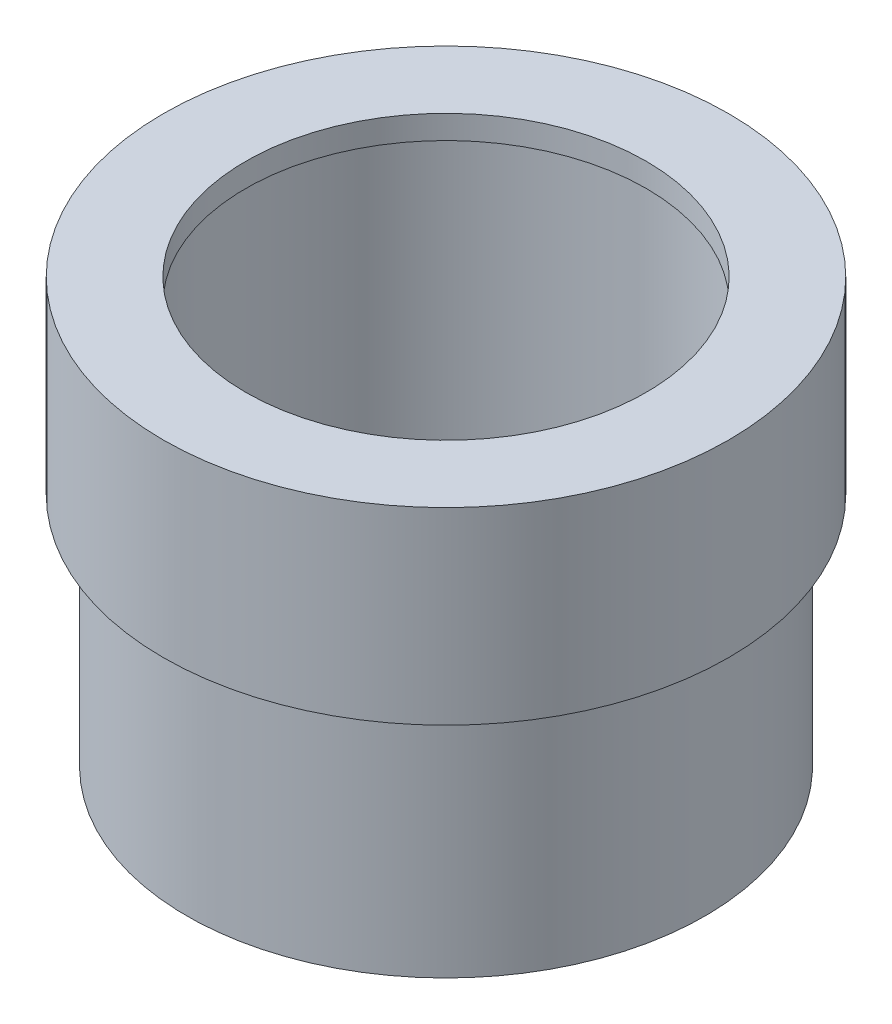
ISO-10303-21;
HEADER;
FILE_DESCRIPTION(('STEP AP214'),'2;1');
FILE_NAME('part.step','',(''),(''),'','','');
FILE_SCHEMA(('AUTOMOTIVE_DESIGN { 1 0 10303 214 1 1 1 1 }'));
ENDSEC;
DATA;
#1=APPLICATION_CONTEXT('core data for automotive mechanical design processes');
#2=APPLICATION_PROTOCOL_DEFINITION('international standard','automotive_design',2000,#1);
#3=PRODUCT_CONTEXT('',#1,'mechanical');
#4=PRODUCT('Part','Part','',(#3));
#5=PRODUCT_RELATED_PRODUCT_CATEGORY('part','',(#4));
#6=PRODUCT_DEFINITION_FORMATION('','',#4);
#7=PRODUCT_DEFINITION_CONTEXT('part definition',#1,'design');
#8=PRODUCT_DEFINITION('design','',#6,#7);
#9=PRODUCT_DEFINITION_SHAPE('','',#8);
#10=(LENGTH_UNIT() NAMED_UNIT(*) SI_UNIT(.MILLI.,.METRE.));
#11=(NAMED_UNIT(*) PLANE_ANGLE_UNIT() SI_UNIT($,.RADIAN.));
#12=(NAMED_UNIT(*) SI_UNIT($,.STERADIAN.) SOLID_ANGLE_UNIT());
#13=UNCERTAINTY_MEASURE_WITH_UNIT(LENGTH_MEASURE(1.E-05),#10,'distance_accuracy_value','');
#14=(GEOMETRIC_REPRESENTATION_CONTEXT(3) GLOBAL_UNCERTAINTY_ASSIGNED_CONTEXT((#13)) GLOBAL_UNIT_ASSIGNED_CONTEXT((#10,
#11,#12)) REPRESENTATION_CONTEXT('',''));
#15=CARTESIAN_POINT('',(0.,0.,0.));
#16=DIRECTION('',(0.,0.,1.));
#17=DIRECTION('',(1.,0.,0.));
#18=AXIS2_PLACEMENT_3D('',#15,#16,#17);
#19=CARTESIAN_POINT('',(17.4625,0.,0.));
#20=DIRECTION('',(0.,-1.,0.));
#21=DIRECTION('',(0.,0.,-1.));
#22=AXIS2_PLACEMENT_3D('',#19,#20,#21);
#23=PLANE('',#22);
#24=CARTESIAN_POINT('',(0.,0.,0.));
#25=DIRECTION('',(0.,-1.,0.));
#26=DIRECTION('',(0.,0.,-1.));
#27=AXIS2_PLACEMENT_3D('',#24,#25,#26);
#28=CIRCLE('',#27,17.4625);
#29=CARTESIAN_POINT('',(0.,0.,-17.4625));
#30=VERTEX_POINT('',#29);
#31=EDGE_CURVE('E56',#30,#30,#28,.T.);
#32=ORIENTED_EDGE('',*,*,#31,.T.);
#33=EDGE_LOOP('',(#32));
#34=FACE_BOUND('',#33,.T.);
#35=CARTESIAN_POINT('',(0.,0.,0.));
#36=DIRECTION('',(0.,-1.,0.));
#37=DIRECTION('',(0.,0.,-1.));
#38=AXIS2_PLACEMENT_3D('',#35,#36,#37);
#39=CIRCLE('',#38,14.2875);
#40=CARTESIAN_POINT('',(0.,0.,-14.2875));
#41=VERTEX_POINT('',#40);
#42=EDGE_CURVE('E10',#41,#41,#39,.T.);
#43=ORIENTED_EDGE('',*,*,#42,.F.);
#44=EDGE_LOOP('',(#43));
#45=FACE_BOUND('',#44,.T.);
#46=ADVANCED_FACE('F28',(#34,#45),#23,.T.);
#47=CARTESIAN_POINT('',(0.,0.,0.));
#48=DIRECTION('',(0.,-1.,0.));
#49=DIRECTION('',(0.,0.,-1.));
#50=AXIS2_PLACEMENT_3D('',#47,#48,#49);
#51=CYLINDRICAL_SURFACE('',#50,14.2875);
#52=ORIENTED_EDGE('',*,*,#42,.T.);
#53=EDGE_LOOP('',(#52));
#54=FACE_BOUND('',#53,.T.);
#55=CARTESIAN_POINT('',(0.,26.9875,0.));
#56=DIRECTION('',(0.,-1.,0.));
#57=DIRECTION('',(0.,0.,-1.));
#58=AXIS2_PLACEMENT_3D('',#55,#56,#57);
#59=CIRCLE('',#58,14.2875);
#60=CARTESIAN_POINT('',(0.,26.9875,-14.2875));
#61=VERTEX_POINT('',#60);
#62=EDGE_CURVE('E34',#61,#61,#59,.T.);
#63=ORIENTED_EDGE('',*,*,#62,.F.);
#64=EDGE_LOOP('',(#63));
#65=FACE_BOUND('',#64,.T.);
#66=ADVANCED_FACE('F74',(#54,#65),#51,.F.);
#67=CARTESIAN_POINT('',(14.2875,26.9875,0.));
#68=DIRECTION('',(0.,-1.,0.));
#69=DIRECTION('',(0.,0.,-1.));
#70=AXIS2_PLACEMENT_3D('',#67,#68,#69);
#71=PLANE('',#70);
#72=ORIENTED_EDGE('',*,*,#62,.T.);
#73=EDGE_LOOP('',(#72));
#74=FACE_BOUND('',#73,.T.);
#75=CARTESIAN_POINT('',(0.,26.9875,0.));
#76=DIRECTION('',(0.,-1.,0.));
#77=DIRECTION('',(0.,0.,-1.));
#78=AXIS2_PLACEMENT_3D('',#75,#76,#77);
#79=CIRCLE('',#78,13.49375);
#80=CARTESIAN_POINT('',(0.,26.9875,-13.49375));
#81=VERTEX_POINT('',#80);
#82=EDGE_CURVE('E38',#81,#81,#79,.T.);
#83=ORIENTED_EDGE('',*,*,#82,.F.);
#84=EDGE_LOOP('',(#83));
#85=FACE_BOUND('',#84,.T.);
#86=ADVANCED_FACE('F78',(#74,#85),#71,.T.);
#87=CARTESIAN_POINT('',(0.,0.,0.));
#88=DIRECTION('',(0.,-1.,0.));
#89=DIRECTION('',(0.,0.,-1.));
#90=AXIS2_PLACEMENT_3D('',#87,#88,#89);
#91=CYLINDRICAL_SURFACE('',#90,13.49375);
#92=ORIENTED_EDGE('',*,*,#82,.T.);
#93=EDGE_LOOP('',(#92));
#94=FACE_BOUND('',#93,.T.);
#95=CARTESIAN_POINT('',(0.,28.575,0.));
#96=DIRECTION('',(0.,-1.,0.));
#97=DIRECTION('',(0.,0.,-1.));
#98=AXIS2_PLACEMENT_3D('',#95,#96,#97);
#99=CIRCLE('',#98,13.49375);
#100=CARTESIAN_POINT('',(0.,28.575,-13.49375));
#101=VERTEX_POINT('',#100);
#102=EDGE_CURVE('E42',#101,#101,#99,.T.);
#103=ORIENTED_EDGE('',*,*,#102,.F.);
#104=EDGE_LOOP('',(#103));
#105=FACE_BOUND('',#104,.T.);
#106=ADVANCED_FACE('F82',(#94,#105),#91,.F.);
#107=CARTESIAN_POINT('',(13.49375,28.575,0.));
#108=DIRECTION('',(0.,1.,0.));
#109=DIRECTION('',(0.,0.,1.));
#110=AXIS2_PLACEMENT_3D('',#107,#108,#109);
#111=PLANE('',#110);
#112=ORIENTED_EDGE('',*,*,#102,.T.);
#113=EDGE_LOOP('',(#112));
#114=FACE_BOUND('',#113,.T.);
#115=CARTESIAN_POINT('',(0.,28.575,0.));
#116=DIRECTION('',(0.,-1.,0.));
#117=DIRECTION('',(0.,0.,-1.));
#118=AXIS2_PLACEMENT_3D('',#115,#116,#117);
#119=CIRCLE('',#118,19.05);
#120=CARTESIAN_POINT('',(0.,28.575,-19.05));
#121=VERTEX_POINT('',#120);
#122=EDGE_CURVE('E47',#121,#121,#119,.T.);
#123=ORIENTED_EDGE('',*,*,#122,.F.);
#124=EDGE_LOOP('',(#123));
#125=FACE_BOUND('',#124,.T.);
#126=ADVANCED_FACE('F88',(#114,#125),#111,.T.);
#127=CARTESIAN_POINT('',(0.,0.,0.));
#128=DIRECTION('',(0.,-1.,0.));
#129=DIRECTION('',(0.,0.,-1.));
#130=AXIS2_PLACEMENT_3D('',#127,#128,#129);
#131=CYLINDRICAL_SURFACE('',#130,19.05);
#132=ORIENTED_EDGE('',*,*,#122,.T.);
#133=EDGE_LOOP('',(#132));
#134=FACE_BOUND('',#133,.T.);
#135=CARTESIAN_POINT('',(0.,15.875,0.));
#136=DIRECTION('',(0.,-1.,0.));
#137=DIRECTION('',(0.,0.,-1.));
#138=AXIS2_PLACEMENT_3D('',#135,#136,#137);
#139=CIRCLE('',#138,19.05);
#140=CARTESIAN_POINT('',(0.,15.875,-19.05));
#141=VERTEX_POINT('',#140);
#142=EDGE_CURVE('E50',#141,#141,#139,.T.);
#143=ORIENTED_EDGE('',*,*,#142,.F.);
#144=EDGE_LOOP('',(#143));
#145=FACE_BOUND('',#144,.T.);
#146=ADVANCED_FACE('F70',(#134,#145),#131,.T.);
#147=CARTESIAN_POINT('',(19.05,15.875,0.));
#148=DIRECTION('',(0.,-1.,0.));
#149=DIRECTION('',(0.,0.,-1.));
#150=AXIS2_PLACEMENT_3D('',#147,#148,#149);
#151=PLANE('',#150);
#152=ORIENTED_EDGE('',*,*,#142,.T.);
#153=EDGE_LOOP('',(#152));
#154=FACE_BOUND('',#153,.T.);
#155=CARTESIAN_POINT('',(0.,15.875,0.));
#156=DIRECTION('',(0.,-1.,0.));
#157=DIRECTION('',(0.,0.,-1.));
#158=AXIS2_PLACEMENT_3D('',#155,#156,#157);
#159=CIRCLE('',#158,17.4625);
#160=CARTESIAN_POINT('',(0.,15.875,-17.4625));
#161=VERTEX_POINT('',#160);
#162=EDGE_CURVE('E53',#161,#161,#159,.T.);
#163=ORIENTED_EDGE('',*,*,#162,.F.);
#164=EDGE_LOOP('',(#163));
#165=FACE_BOUND('',#164,.T.);
#166=ADVANCED_FACE('F64',(#154,#165),#151,.T.);
#167=CARTESIAN_POINT('',(0.,0.,0.));
#168=DIRECTION('',(0.,-1.,0.));
#169=DIRECTION('',(0.,0.,-1.));
#170=AXIS2_PLACEMENT_3D('',#167,#168,#169);
#171=CYLINDRICAL_SURFACE('',#170,17.4625);
#172=ORIENTED_EDGE('',*,*,#162,.T.);
#173=EDGE_LOOP('',(#172));
#174=FACE_BOUND('',#173,.T.);
#175=ORIENTED_EDGE('',*,*,#31,.F.);
#176=EDGE_LOOP('',(#175));
#177=FACE_BOUND('',#176,.T.);
#178=ADVANCED_FACE('F62',(#174,#177),#171,.T.);
#179=CLOSED_SHELL('',(#46,#66,#86,#106,#126,#146,#166,#178));
#180=MANIFOLD_SOLID_BREP('B2',#179);
#181=ADVANCED_BREP_SHAPE_REPRESENTATION('',(#18,#180),#14);
#182=SHAPE_DEFINITION_REPRESENTATION(#9,#181);
ENDSEC;
END-ISO-10303-21;
